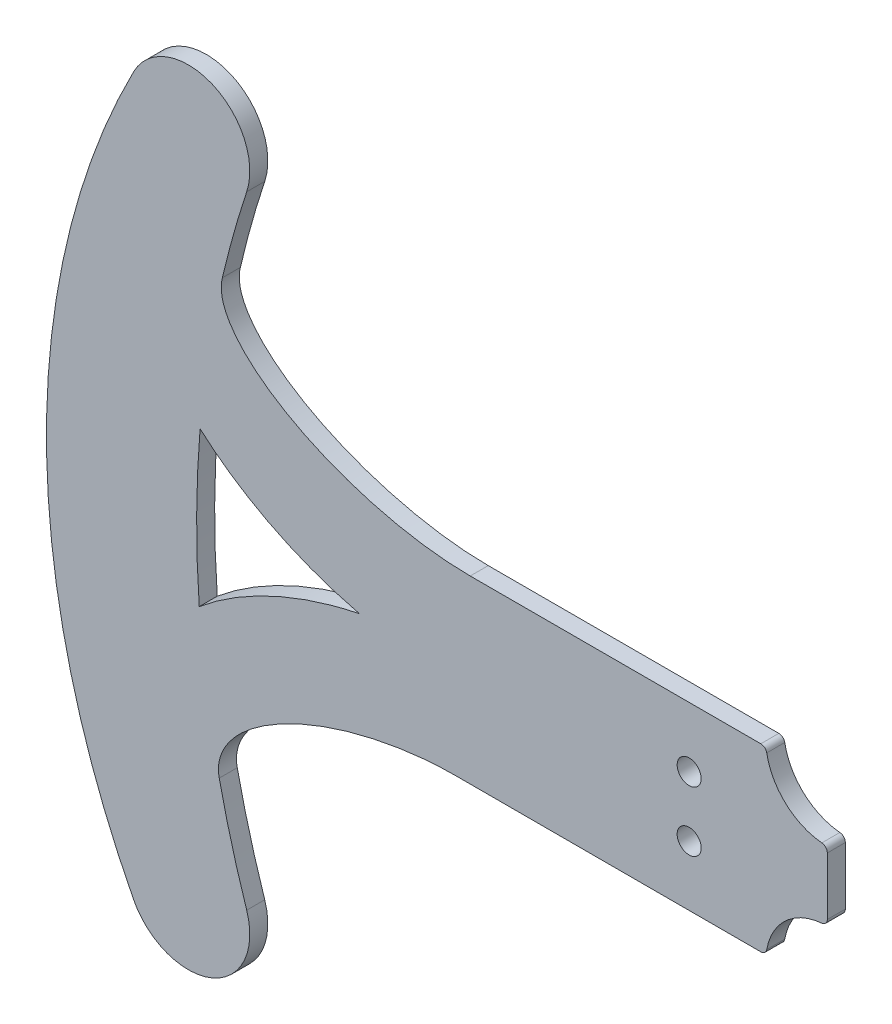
ISO-10303-21;
HEADER;
FILE_DESCRIPTION(('STEP AP214'),'2;1');
FILE_NAME('part.step','',(''),(''),'','','');
FILE_SCHEMA(('AUTOMOTIVE_DESIGN { 1 0 10303 214 1 1 1 1 }'));
ENDSEC;
DATA;
#1=APPLICATION_CONTEXT('core data for automotive mechanical design processes');
#2=APPLICATION_PROTOCOL_DEFINITION('international standard','automotive_design',2000,#1);
#3=PRODUCT_CONTEXT('',#1,'mechanical');
#4=PRODUCT('Part','Part','',(#3));
#5=PRODUCT_RELATED_PRODUCT_CATEGORY('part','',(#4));
#6=PRODUCT_DEFINITION_FORMATION('','',#4);
#7=PRODUCT_DEFINITION_CONTEXT('part definition',#1,'design');
#8=PRODUCT_DEFINITION('design','',#6,#7);
#9=PRODUCT_DEFINITION_SHAPE('','',#8);
#10=(LENGTH_UNIT() NAMED_UNIT(*) SI_UNIT(.MILLI.,.METRE.));
#11=(NAMED_UNIT(*) PLANE_ANGLE_UNIT() SI_UNIT($,.RADIAN.));
#12=(NAMED_UNIT(*) SI_UNIT($,.STERADIAN.) SOLID_ANGLE_UNIT());
#13=UNCERTAINTY_MEASURE_WITH_UNIT(LENGTH_MEASURE(1.E-05),#10,'distance_accuracy_value','');
#14=(GEOMETRIC_REPRESENTATION_CONTEXT(3) GLOBAL_UNCERTAINTY_ASSIGNED_CONTEXT((#13)) GLOBAL_UNIT_ASSIGNED_CONTEXT((#10,
#11,#12)) REPRESENTATION_CONTEXT('',''));
#15=CARTESIAN_POINT('',(0.,0.,0.));
#16=DIRECTION('',(0.,0.,1.));
#17=DIRECTION('',(1.,0.,0.));
#18=AXIS2_PLACEMENT_3D('',#15,#16,#17);
#19=CARTESIAN_POINT('',(-71.7050452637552,29.7169195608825,3.));
#20=DIRECTION('',(0.,0.,1.));
#21=DIRECTION('',(1.,0.,0.));
#22=AXIS2_PLACEMENT_3D('',#19,#20,#21);
#23=PLANE('',#22);
#24=CARTESIAN_POINT('',(-23.,5.,3.));
#25=DIRECTION('',(0.,0.,1.));
#26=DIRECTION('',(1.,0.,0.));
#27=AXIS2_PLACEMENT_3D('',#24,#25,#26);
#28=CIRCLE('',#27,2.);
#29=CARTESIAN_POINT('',(-21.,5.,3.));
#30=VERTEX_POINT('',#29);
#31=EDGE_CURVE('E179',#30,#30,#28,.T.);
#32=ORIENTED_EDGE('',*,*,#31,.F.);
#33=EDGE_LOOP('',(#32));
#34=FACE_BOUND('',#33,.T.);
#35=CARTESIAN_POINT('',(60.,0.,3.));
#36=DIRECTION('',(0.,0.,-1.));
#37=DIRECTION('',(1.,0.,0.));
#38=AXIS2_PLACEMENT_3D('',#35,#36,#37);
#39=CIRCLE('',#38,165.);
#40=CARTESIAN_POINT('',(-96.6626097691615,-51.7863563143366,3.));
#41=VERTEX_POINT('',#40);
#42=CARTESIAN_POINT('',(-101.237477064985,-35.0353534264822,3.));
#43=VERTEX_POINT('',#42);
#44=EDGE_CURVE('E325',#41,#43,#39,.T.);
#45=ORIENTED_EDGE('',*,*,#44,.T.);
#46=CARTESIAN_POINT('',(-71.8420437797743,-29.0459008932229,3.));
#47=DIRECTION('',(0.,0.,-1.));
#48=DIRECTION('',(-0.980460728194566,-0.196714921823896,0.));
#49=AXIS2_PLACEMENT_3D('',#46,#47,#48);
#50=ELLIPSE('',#49,30.,13.);
#51=CARTESIAN_POINT('',(-61.8043189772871,-15.,3.));
#52=VERTEX_POINT('',#51);
#53=EDGE_CURVE('E328',#43,#52,#50,.T.);
#54=ORIENTED_EDGE('',*,*,#53,.T.);
#55=DIRECTION('',(1.,0.,0.));
#56=VECTOR('',#55,1.);
#57=CARTESIAN_POINT('',(-11.0707949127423,-15.,3.));
#58=LINE('',#57,#56);
#59=CARTESIAN_POINT('',(-11.0707949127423,-15.,3.));
#60=VERTEX_POINT('',#59);
#61=EDGE_CURVE('E288',#52,#60,#58,.T.);
#62=ORIENTED_EDGE('',*,*,#61,.T.);
#63=CARTESIAN_POINT('',(-11.0707949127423,-14.,3.));
#64=DIRECTION('',(0.,0.,1.));
#65=DIRECTION('',(1.,0.,0.));
#66=AXIS2_PLACEMENT_3D('',#63,#64,#65);
#67=CIRCLE('',#66,0.999999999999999);
#68=CARTESIAN_POINT('',(-10.0867242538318,-14.1777777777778,3.));
#69=VERTEX_POINT('',#68);
#70=EDGE_CURVE('E397',#60,#69,#67,.T.);
#71=ORIENTED_EDGE('',*,*,#70,.T.);
#72=CARTESIAN_POINT('',(0.,-16.,3.));
#73=DIRECTION('',(0.,0.,-1.));
#74=DIRECTION('',(1.,0.,0.));
#75=AXIS2_PLACEMENT_3D('',#72,#73,#74);
#76=CIRCLE('',#75,10.25);
#77=CARTESIAN_POINT('',(-0.91111111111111,-5.79057413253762,3.));
#78=VERTEX_POINT('',#77);
#79=EDGE_CURVE('E396',#69,#78,#76,.T.);
#80=ORIENTED_EDGE('',*,*,#79,.T.);
#81=CARTESIAN_POINT('',(-0.999999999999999,-4.79453258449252,3.));
#82=DIRECTION('',(0.,0.,1.));
#83=DIRECTION('',(1.,0.,0.));
#84=AXIS2_PLACEMENT_3D('',#81,#82,#83);
#85=CIRCLE('',#84,1.);
#86=CARTESIAN_POINT('',(0.,-4.79453258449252,3.));
#87=VERTEX_POINT('',#86);
#88=EDGE_CURVE('E394',#78,#87,#85,.T.);
#89=ORIENTED_EDGE('',*,*,#88,.T.);
#90=DIRECTION('',(0.,1.,0.));
#91=VECTOR('',#90,1.);
#92=CARTESIAN_POINT('',(0.,4.79453258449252,3.));
#93=LINE('',#92,#91);
#94=CARTESIAN_POINT('',(0.,4.79453258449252,3.));
#95=VERTEX_POINT('',#94);
#96=EDGE_CURVE('E392',#87,#95,#93,.T.);
#97=ORIENTED_EDGE('',*,*,#96,.T.);
#98=CARTESIAN_POINT('',(-1.,4.79453258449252,3.));
#99=DIRECTION('',(0.,0.,1.));
#100=DIRECTION('',(1.,0.,0.));
#101=AXIS2_PLACEMENT_3D('',#98,#99,#100);
#102=CIRCLE('',#101,1.);
#103=CARTESIAN_POINT('',(-0.911111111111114,5.79057413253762,3.));
#104=VERTEX_POINT('',#103);
#105=EDGE_CURVE('E388',#95,#104,#102,.T.);
#106=ORIENTED_EDGE('',*,*,#105,.T.);
#107=CARTESIAN_POINT('',(0.,16.,3.));
#108=DIRECTION('',(0.,0.,-1.));
#109=DIRECTION('',(1.,0.,0.));
#110=AXIS2_PLACEMENT_3D('',#107,#108,#109);
#111=CIRCLE('',#110,10.25);
#112=CARTESIAN_POINT('',(-10.0867242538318,14.1777777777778,3.));
#113=VERTEX_POINT('',#112);
#114=EDGE_CURVE('E387',#104,#113,#111,.T.);
#115=ORIENTED_EDGE('',*,*,#114,.T.);
#116=CARTESIAN_POINT('',(-11.0707949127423,14.,3.));
#117=DIRECTION('',(0.,0.,1.));
#118=DIRECTION('',(1.,0.,0.));
#119=AXIS2_PLACEMENT_3D('',#116,#117,#118);
#120=CIRCLE('',#119,1.);
#121=CARTESIAN_POINT('',(-11.0707949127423,15.,3.));
#122=VERTEX_POINT('',#121);
#123=EDGE_CURVE('E386',#113,#122,#120,.T.);
#124=ORIENTED_EDGE('',*,*,#123,.T.);
#125=DIRECTION('',(-1.,0.,0.));
#126=VECTOR('',#125,1.);
#127=CARTESIAN_POINT('',(-59.4512131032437,15.,3.));
#128=LINE('',#127,#126);
#129=CARTESIAN_POINT('',(-59.4512131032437,15.,3.));
#130=VERTEX_POINT('',#129);
#131=EDGE_CURVE('E230',#122,#130,#128,.T.);
#132=ORIENTED_EDGE('',*,*,#131,.T.);
#133=CARTESIAN_POINT('',(-71.7050452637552,29.7169195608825,3.));
#134=DIRECTION('',(0.,0.,-1.));
#135=DIRECTION('',(-0.966902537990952,0.255146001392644,0.));
#136=AXIS2_PLACEMENT_3D('',#133,#134,#135);
#137=ELLIPSE('',#136,30.,13.);
#138=CARTESIAN_POINT('',(-100.712121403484,37.3712996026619,3.));
#139=VERTEX_POINT('',#138);
#140=EDGE_CURVE('E225',#130,#139,#137,.T.);
#141=ORIENTED_EDGE('',*,*,#140,.T.);
#142=CARTESIAN_POINT('',(60.,0.,3.));
#143=DIRECTION('',(0.,0.,-1.));
#144=DIRECTION('',(1.,0.,0.));
#145=AXIS2_PLACEMENT_3D('',#142,#143,#144);
#146=CIRCLE('',#145,165.);
#147=CARTESIAN_POINT('',(-96.6626097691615,51.7863563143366,3.));
#148=VERTEX_POINT('',#147);
#149=EDGE_CURVE('E229',#139,#148,#146,.T.);
#150=ORIENTED_EDGE('',*,*,#149,.T.);
#151=CARTESIAN_POINT('',(-106.384433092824,55.,3.));
#152=DIRECTION('',(0.,0.,1.));
#153=DIRECTION('',(1.,0.,0.));
#154=AXIS2_PLACEMENT_3D('',#151,#152,#153);
#155=CIRCLE('',#154,10.2392067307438);
#156=CARTESIAN_POINT('',(-115.479999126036,59.7023433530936,3.));
#157=VERTEX_POINT('',#156);
#158=EDGE_CURVE('E233',#148,#157,#155,.T.);
#159=ORIENTED_EDGE('',*,*,#158,.T.);
#160=CARTESIAN_POINT('',(0.,0.,3.));
#161=DIRECTION('',(0.,0.,1.));
#162=DIRECTION('',(1.,0.,0.));
#163=AXIS2_PLACEMENT_3D('',#160,#161,#162);
#164=CIRCLE('',#163,130.);
#165=CARTESIAN_POINT('',(-115.479999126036,-59.7023433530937,3.));
#166=VERTEX_POINT('',#165);
#167=EDGE_CURVE('E235',#157,#166,#164,.T.);
#168=ORIENTED_EDGE('',*,*,#167,.T.);
#169=CARTESIAN_POINT('',(-106.384433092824,-55.,3.));
#170=DIRECTION('',(0.,0.,1.));
#171=DIRECTION('',(1.,0.,0.));
#172=AXIS2_PLACEMENT_3D('',#169,#170,#171);
#173=CIRCLE('',#172,10.2392067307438);
#174=EDGE_CURVE('E237',#166,#41,#173,.T.);
#175=ORIENTED_EDGE('',*,*,#174,.T.);
#176=EDGE_LOOP('',(#45,#54,#62,#71,#80,#89,#97,#106,#115,#124,#132,#141,#150,#159,#168,#175));
#177=FACE_BOUND('',#176,.T.);
#178=CARTESIAN_POINT('',(-71.8420437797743,-29.0459008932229,3.));
#179=DIRECTION('',(0.,0.,-1.));
#180=DIRECTION('',(0.980460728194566,0.196714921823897,0.));
#181=AXIS2_PLACEMENT_3D('',#178,#179,#180);
#182=ELLIPSE('',#181,45.2509352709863,30.);
#183=CARTESIAN_POINT('',(-104.56533781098,-11.9686921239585,3.));
#184=VERTEX_POINT('',#183);
#185=CARTESIAN_POINT('',(-77.8874428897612,0.338878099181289,3.));
#186=VERTEX_POINT('',#185);
#187=EDGE_CURVE('E421',#184,#186,#182,.T.);
#188=ORIENTED_EDGE('',*,*,#187,.F.);
#189=CARTESIAN_POINT('',(60.,0.,3.));
#190=DIRECTION('',(0.,0.,1.));
#191=DIRECTION('',(1.,0.,0.));
#192=AXIS2_PLACEMENT_3D('',#189,#190,#191);
#193=CIRCLE('',#192,165.);
#194=CARTESIAN_POINT('',(-104.426529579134,13.7446851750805,3.));
#195=VERTEX_POINT('',#194);
#196=EDGE_CURVE('E189',#195,#184,#193,.T.);
#197=ORIENTED_EDGE('',*,*,#196,.F.);
#198=CARTESIAN_POINT('',(-71.7050452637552,29.7169195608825,3.));
#199=DIRECTION('',(0.,0.,-1.));
#200=DIRECTION('',(0.966902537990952,-0.255146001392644,0.));
#201=AXIS2_PLACEMENT_3D('',#198,#199,#200);
#202=ELLIPSE('',#201,45.2509352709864,30.);
#203=EDGE_CURVE('E174',#186,#195,#202,.T.);
#204=ORIENTED_EDGE('',*,*,#203,.F.);
#205=EDGE_LOOP('',(#188,#197,#204));
#206=FACE_BOUND('',#205,.T.);
#207=CARTESIAN_POINT('',(-23.,-5.,3.));
#208=DIRECTION('',(0.,0.,1.));
#209=DIRECTION('',(1.,0.,0.));
#210=AXIS2_PLACEMENT_3D('',#207,#208,#209);
#211=CIRCLE('',#210,2.);
#212=CARTESIAN_POINT('',(-21.,-5.,3.));
#213=VERTEX_POINT('',#212);
#214=EDGE_CURVE('E438',#213,#213,#211,.T.);
#215=ORIENTED_EDGE('',*,*,#214,.F.);
#216=EDGE_LOOP('',(#215));
#217=FACE_BOUND('',#216,.T.);
#218=ADVANCED_FACE('F31',(#34,#177,#206,#217),#23,.T.);
#219=CARTESIAN_POINT('',(-71.7050452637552,29.7169195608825,0.));
#220=DIRECTION('',(0.,0.,1.));
#221=DIRECTION('',(1.,0.,0.));
#222=AXIS2_PLACEMENT_3D('',#219,#220,#221);
#223=PLANE('',#222);
#224=CARTESIAN_POINT('',(-23.,5.,0.));
#225=DIRECTION('',(0.,0.,1.));
#226=DIRECTION('',(1.,0.,0.));
#227=AXIS2_PLACEMENT_3D('',#224,#225,#226);
#228=CIRCLE('',#227,2.);
#229=CARTESIAN_POINT('',(-21.,5.,0.));
#230=VERTEX_POINT('',#229);
#231=EDGE_CURVE('E182',#230,#230,#228,.T.);
#232=ORIENTED_EDGE('',*,*,#231,.T.);
#233=EDGE_LOOP('',(#232));
#234=FACE_BOUND('',#233,.T.);
#235=CARTESIAN_POINT('',(60.,0.,0.));
#236=DIRECTION('',(0.,0.,-1.));
#237=DIRECTION('',(1.,0.,0.));
#238=AXIS2_PLACEMENT_3D('',#235,#236,#237);
#239=CIRCLE('',#238,165.);
#240=CARTESIAN_POINT('',(-96.6626097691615,-51.7863563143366,0.));
#241=VERTEX_POINT('',#240);
#242=CARTESIAN_POINT('',(-101.237477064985,-35.0353534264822,0.));
#243=VERTEX_POINT('',#242);
#244=EDGE_CURVE('E175',#241,#243,#239,.T.);
#245=ORIENTED_EDGE('',*,*,#244,.F.);
#246=CARTESIAN_POINT('',(-106.384433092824,-55.,0.));
#247=DIRECTION('',(0.,0.,1.));
#248=DIRECTION('',(1.,0.,0.));
#249=AXIS2_PLACEMENT_3D('',#246,#247,#248);
#250=CIRCLE('',#249,10.2392067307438);
#251=CARTESIAN_POINT('',(-115.479999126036,-59.7023433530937,0.));
#252=VERTEX_POINT('',#251);
#253=EDGE_CURVE('E323',#252,#241,#250,.T.);
#254=ORIENTED_EDGE('',*,*,#253,.F.);
#255=CARTESIAN_POINT('',(0.,0.,0.));
#256=DIRECTION('',(0.,0.,1.));
#257=DIRECTION('',(1.,0.,0.));
#258=AXIS2_PLACEMENT_3D('',#255,#256,#257);
#259=CIRCLE('',#258,130.);
#260=CARTESIAN_POINT('',(-115.479999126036,59.7023433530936,0.));
#261=VERTEX_POINT('',#260);
#262=EDGE_CURVE('E321',#261,#252,#259,.T.);
#263=ORIENTED_EDGE('',*,*,#262,.F.);
#264=CARTESIAN_POINT('',(-106.384433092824,55.,0.));
#265=DIRECTION('',(0.,0.,1.));
#266=DIRECTION('',(1.,0.,0.));
#267=AXIS2_PLACEMENT_3D('',#264,#265,#266);
#268=CIRCLE('',#267,10.2392067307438);
#269=CARTESIAN_POINT('',(-96.6626097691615,51.7863563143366,0.));
#270=VERTEX_POINT('',#269);
#271=EDGE_CURVE('E319',#270,#261,#268,.T.);
#272=ORIENTED_EDGE('',*,*,#271,.F.);
#273=CARTESIAN_POINT('',(60.,0.,0.));
#274=DIRECTION('',(0.,0.,-1.));
#275=DIRECTION('',(1.,0.,0.));
#276=AXIS2_PLACEMENT_3D('',#273,#274,#275);
#277=CIRCLE('',#276,165.);
#278=CARTESIAN_POINT('',(-100.712121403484,37.3712996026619,0.));
#279=VERTEX_POINT('',#278);
#280=EDGE_CURVE('E317',#279,#270,#277,.T.);
#281=ORIENTED_EDGE('',*,*,#280,.F.);
#282=CARTESIAN_POINT('',(-71.7050452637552,29.7169195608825,0.));
#283=DIRECTION('',(0.,0.,-1.));
#284=DIRECTION('',(-0.966902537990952,0.255146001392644,0.));
#285=AXIS2_PLACEMENT_3D('',#282,#283,#284);
#286=ELLIPSE('',#285,30.,13.);
#287=CARTESIAN_POINT('',(-59.4512131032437,15.,0.));
#288=VERTEX_POINT('',#287);
#289=EDGE_CURVE('E315',#288,#279,#286,.T.);
#290=ORIENTED_EDGE('',*,*,#289,.F.);
#291=DIRECTION('',(-1.,0.,0.));
#292=VECTOR('',#291,1.);
#293=CARTESIAN_POINT('',(-59.4512131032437,15.,0.));
#294=LINE('',#293,#292);
#295=CARTESIAN_POINT('',(-11.0707949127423,15.,0.));
#296=VERTEX_POINT('',#295);
#297=EDGE_CURVE('E313',#296,#288,#294,.T.);
#298=ORIENTED_EDGE('',*,*,#297,.F.);
#299=CARTESIAN_POINT('',(-11.0707949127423,14.,0.));
#300=DIRECTION('',(0.,0.,1.));
#301=DIRECTION('',(1.,0.,0.));
#302=AXIS2_PLACEMENT_3D('',#299,#300,#301);
#303=CIRCLE('',#302,1.);
#304=CARTESIAN_POINT('',(-10.0867242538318,14.1777777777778,0.));
#305=VERTEX_POINT('',#304);
#306=EDGE_CURVE('E311',#305,#296,#303,.T.);
#307=ORIENTED_EDGE('',*,*,#306,.F.);
#308=CARTESIAN_POINT('',(0.,16.,0.));
#309=DIRECTION('',(0.,0.,-1.));
#310=DIRECTION('',(1.,0.,0.));
#311=AXIS2_PLACEMENT_3D('',#308,#309,#310);
#312=CIRCLE('',#311,10.25);
#313=CARTESIAN_POINT('',(-0.911111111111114,5.79057413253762,0.));
#314=VERTEX_POINT('',#313);
#315=EDGE_CURVE('E309',#314,#305,#312,.T.);
#316=ORIENTED_EDGE('',*,*,#315,.F.);
#317=CARTESIAN_POINT('',(-1.,4.79453258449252,0.));
#318=DIRECTION('',(0.,0.,1.));
#319=DIRECTION('',(1.,0.,0.));
#320=AXIS2_PLACEMENT_3D('',#317,#318,#319);
#321=CIRCLE('',#320,1.);
#322=CARTESIAN_POINT('',(0.,4.79453258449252,0.));
#323=VERTEX_POINT('',#322);
#324=EDGE_CURVE('E307',#323,#314,#321,.T.);
#325=ORIENTED_EDGE('',*,*,#324,.F.);
#326=DIRECTION('',(0.,1.,0.));
#327=VECTOR('',#326,1.);
#328=CARTESIAN_POINT('',(0.,4.79453258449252,0.));
#329=LINE('',#328,#327);
#330=CARTESIAN_POINT('',(0.,-4.79453258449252,0.));
#331=VERTEX_POINT('',#330);
#332=EDGE_CURVE('E305',#331,#323,#329,.T.);
#333=ORIENTED_EDGE('',*,*,#332,.F.);
#334=CARTESIAN_POINT('',(-0.999999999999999,-4.79453258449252,0.));
#335=DIRECTION('',(0.,0.,1.));
#336=DIRECTION('',(1.,0.,0.));
#337=AXIS2_PLACEMENT_3D('',#334,#335,#336);
#338=CIRCLE('',#337,1.);
#339=CARTESIAN_POINT('',(-0.91111111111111,-5.79057413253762,0.));
#340=VERTEX_POINT('',#339);
#341=EDGE_CURVE('E303',#340,#331,#338,.T.);
#342=ORIENTED_EDGE('',*,*,#341,.F.);
#343=CARTESIAN_POINT('',(0.,-16.,0.));
#344=DIRECTION('',(0.,0.,-1.));
#345=DIRECTION('',(1.,0.,0.));
#346=AXIS2_PLACEMENT_3D('',#343,#344,#345);
#347=CIRCLE('',#346,10.25);
#348=CARTESIAN_POINT('',(-10.0867242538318,-14.1777777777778,0.));
#349=VERTEX_POINT('',#348);
#350=EDGE_CURVE('E297',#349,#340,#347,.T.);
#351=ORIENTED_EDGE('',*,*,#350,.F.);
#352=CARTESIAN_POINT('',(-11.0707949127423,-14.,0.));
#353=DIRECTION('',(0.,0.,1.));
#354=DIRECTION('',(1.,0.,0.));
#355=AXIS2_PLACEMENT_3D('',#352,#353,#354);
#356=CIRCLE('',#355,0.999999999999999);
#357=CARTESIAN_POINT('',(-11.0707949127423,-15.,0.));
#358=VERTEX_POINT('',#357);
#359=EDGE_CURVE('E295',#358,#349,#356,.T.);
#360=ORIENTED_EDGE('',*,*,#359,.F.);
#361=DIRECTION('',(1.,0.,0.));
#362=VECTOR('',#361,1.);
#363=CARTESIAN_POINT('',(-11.0707949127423,-15.,0.));
#364=LINE('',#363,#362);
#365=CARTESIAN_POINT('',(-61.8043189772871,-15.,0.));
#366=VERTEX_POINT('',#365);
#367=EDGE_CURVE('E287',#366,#358,#364,.T.);
#368=ORIENTED_EDGE('',*,*,#367,.F.);
#369=CARTESIAN_POINT('',(-71.8420437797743,-29.0459008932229,0.));
#370=DIRECTION('',(0.,0.,-1.));
#371=DIRECTION('',(-0.980460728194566,-0.196714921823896,0.));
#372=AXIS2_PLACEMENT_3D('',#369,#370,#371);
#373=ELLIPSE('',#372,30.,13.);
#374=EDGE_CURVE('E293',#243,#366,#373,.T.);
#375=ORIENTED_EDGE('',*,*,#374,.F.);
#376=EDGE_LOOP('',(#245,#254,#263,#272,#281,#290,#298,#307,#316,#325,#333,#342,#351,#360,#368,#375));
#377=FACE_BOUND('',#376,.T.);
#378=CARTESIAN_POINT('',(-71.7050452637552,29.7169195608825,0.));
#379=DIRECTION('',(0.,0.,-1.));
#380=DIRECTION('',(0.966902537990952,-0.255146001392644,0.));
#381=AXIS2_PLACEMENT_3D('',#378,#379,#380);
#382=ELLIPSE('',#381,45.2509352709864,30.);
#383=CARTESIAN_POINT('',(-77.8874428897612,0.338878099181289,0.));
#384=VERTEX_POINT('',#383);
#385=CARTESIAN_POINT('',(-104.426529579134,13.7446851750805,0.));
#386=VERTEX_POINT('',#385);
#387=EDGE_CURVE('E167',#384,#386,#382,.T.);
#388=ORIENTED_EDGE('',*,*,#387,.T.);
#389=CARTESIAN_POINT('',(60.,0.,0.));
#390=DIRECTION('',(0.,0.,1.));
#391=DIRECTION('',(1.,0.,0.));
#392=AXIS2_PLACEMENT_3D('',#389,#390,#391);
#393=CIRCLE('',#392,165.);
#394=CARTESIAN_POINT('',(-104.56533781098,-11.9686921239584,0.));
#395=VERTEX_POINT('',#394);
#396=EDGE_CURVE('E160',#386,#395,#393,.T.);
#397=ORIENTED_EDGE('',*,*,#396,.T.);
#398=CARTESIAN_POINT('',(-71.8420437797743,-29.0459008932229,0.));
#399=DIRECTION('',(0.,0.,-1.));
#400=DIRECTION('',(0.980460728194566,0.196714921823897,0.));
#401=AXIS2_PLACEMENT_3D('',#398,#399,#400);
#402=ELLIPSE('',#401,45.2509352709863,30.);
#403=EDGE_CURVE('E51',#395,#384,#402,.T.);
#404=ORIENTED_EDGE('',*,*,#403,.T.);
#405=EDGE_LOOP('',(#388,#397,#404));
#406=FACE_BOUND('',#405,.T.);
#407=CARTESIAN_POINT('',(-23.,-5.,0.));
#408=DIRECTION('',(0.,0.,1.));
#409=DIRECTION('',(1.,0.,0.));
#410=AXIS2_PLACEMENT_3D('',#407,#408,#409);
#411=CIRCLE('',#410,2.);
#412=CARTESIAN_POINT('',(-21.,-5.,0.));
#413=VERTEX_POINT('',#412);
#414=EDGE_CURVE('E441',#413,#413,#411,.T.);
#415=ORIENTED_EDGE('',*,*,#414,.T.);
#416=EDGE_LOOP('',(#415));
#417=FACE_BOUND('',#416,.T.);
#418=ADVANCED_FACE('F177',(#234,#377,#406,#417),#223,.F.);
#419=CARTESIAN_POINT('',(60.,0.,3.));
#420=DIRECTION('',(0.,0.,-1.));
#421=DIRECTION('',(-1.,0.,0.));
#422=AXIS2_PLACEMENT_3D('',#419,#420,#421);
#423=CYLINDRICAL_SURFACE('',#422,165.);
#424=ORIENTED_EDGE('',*,*,#244,.T.);
#425=DIRECTION('',(0.,0.,-1.));
#426=VECTOR('',#425,1.);
#427=CARTESIAN_POINT('',(-101.237477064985,-35.0353534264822,3.));
#428=LINE('',#427,#426);
#429=EDGE_CURVE('E11',#43,#243,#428,.T.);
#430=ORIENTED_EDGE('',*,*,#429,.F.);
#431=ORIENTED_EDGE('',*,*,#44,.F.);
#432=DIRECTION('',(0.,0.,-1.));
#433=VECTOR('',#432,1.);
#434=CARTESIAN_POINT('',(-96.6626097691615,-51.7863563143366,3.));
#435=LINE('',#434,#433);
#436=EDGE_CURVE('E239',#41,#241,#435,.T.);
#437=ORIENTED_EDGE('',*,*,#436,.T.);
#438=EDGE_LOOP('',(#424,#430,#431,#437));
#439=FACE_BOUND('',#438,.T.);
#440=ADVANCED_FACE('F33',(#439),#423,.F.);
#441=DIRECTION('',(0.,0.,-1.));
#442=VECTOR('',#441,1.);
#443=SURFACE_OF_LINEAR_EXTRUSION('',#50,#442);
#444=ORIENTED_EDGE('',*,*,#374,.T.);
#445=DIRECTION('',(0.,0.,-1.));
#446=VECTOR('',#445,1.);
#447=CARTESIAN_POINT('',(-61.8043189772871,-15.,3.));
#448=LINE('',#447,#446);
#449=EDGE_CURVE('E39',#52,#366,#448,.T.);
#450=ORIENTED_EDGE('',*,*,#449,.F.);
#451=ORIENTED_EDGE('',*,*,#53,.F.);
#452=ORIENTED_EDGE('',*,*,#429,.T.);
#453=EDGE_LOOP('',(#444,#450,#451,#452));
#454=FACE_BOUND('',#453,.T.);
#455=ADVANCED_FACE('F332',(#454),#443,.F.);
#456=CARTESIAN_POINT('',(-11.0707949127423,-15.,3.));
#457=DIRECTION('',(0.,1.,0.));
#458=DIRECTION('',(-1.,0.,0.));
#459=AXIS2_PLACEMENT_3D('',#456,#457,#458);
#460=PLANE('',#459);
#461=ORIENTED_EDGE('',*,*,#367,.T.);
#462=DIRECTION('',(0.,0.,-1.));
#463=VECTOR('',#462,1.);
#464=CARTESIAN_POINT('',(-11.0707949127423,-15.,3.));
#465=LINE('',#464,#463);
#466=EDGE_CURVE('E278',#60,#358,#465,.T.);
#467=ORIENTED_EDGE('',*,*,#466,.F.);
#468=ORIENTED_EDGE('',*,*,#61,.F.);
#469=ORIENTED_EDGE('',*,*,#449,.T.);
#470=EDGE_LOOP('',(#461,#467,#468,#469));
#471=FACE_BOUND('',#470,.T.);
#472=ADVANCED_FACE('F285',(#471),#460,.F.);
#473=CARTESIAN_POINT('',(-11.0707949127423,-14.,3.));
#474=DIRECTION('',(0.,0.,-1.));
#475=DIRECTION('',(-1.,0.,0.));
#476=AXIS2_PLACEMENT_3D('',#473,#474,#475);
#477=CYLINDRICAL_SURFACE('',#476,0.999999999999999);
#478=ORIENTED_EDGE('',*,*,#359,.T.);
#479=DIRECTION('',(0.,0.,-1.));
#480=VECTOR('',#479,1.);
#481=CARTESIAN_POINT('',(-10.0867242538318,-14.1777777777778,3.));
#482=LINE('',#481,#480);
#483=EDGE_CURVE('E275',#69,#349,#482,.T.);
#484=ORIENTED_EDGE('',*,*,#483,.F.);
#485=ORIENTED_EDGE('',*,*,#70,.F.);
#486=ORIENTED_EDGE('',*,*,#466,.T.);
#487=EDGE_LOOP('',(#478,#484,#485,#486));
#488=FACE_BOUND('',#487,.T.);
#489=ADVANCED_FACE('F337',(#488),#477,.T.);
#490=CARTESIAN_POINT('',(0.,-16.,3.));
#491=DIRECTION('',(0.,0.,-1.));
#492=DIRECTION('',(-1.,0.,0.));
#493=AXIS2_PLACEMENT_3D('',#490,#491,#492);
#494=CYLINDRICAL_SURFACE('',#493,10.25);
#495=ORIENTED_EDGE('',*,*,#350,.T.);
#496=DIRECTION('',(0.,0.,-1.));
#497=VECTOR('',#496,1.);
#498=CARTESIAN_POINT('',(-0.91111111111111,-5.79057413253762,3.));
#499=LINE('',#498,#497);
#500=EDGE_CURVE('E272',#78,#340,#499,.T.);
#501=ORIENTED_EDGE('',*,*,#500,.F.);
#502=ORIENTED_EDGE('',*,*,#79,.F.);
#503=ORIENTED_EDGE('',*,*,#483,.T.);
#504=EDGE_LOOP('',(#495,#501,#502,#503));
#505=FACE_BOUND('',#504,.T.);
#506=ADVANCED_FACE('F340',(#505),#494,.F.);
#507=CARTESIAN_POINT('',(-0.999999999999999,-4.79453258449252,3.));
#508=DIRECTION('',(0.,0.,-1.));
#509=DIRECTION('',(-1.,0.,0.));
#510=AXIS2_PLACEMENT_3D('',#507,#508,#509);
#511=CYLINDRICAL_SURFACE('',#510,1.);
#512=ORIENTED_EDGE('',*,*,#341,.T.);
#513=DIRECTION('',(0.,0.,-1.));
#514=VECTOR('',#513,1.);
#515=CARTESIAN_POINT('',(0.,-4.79453258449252,3.));
#516=LINE('',#515,#514);
#517=EDGE_CURVE('E269',#87,#331,#516,.T.);
#518=ORIENTED_EDGE('',*,*,#517,.F.);
#519=ORIENTED_EDGE('',*,*,#88,.F.);
#520=ORIENTED_EDGE('',*,*,#500,.T.);
#521=EDGE_LOOP('',(#512,#518,#519,#520));
#522=FACE_BOUND('',#521,.T.);
#523=ADVANCED_FACE('F344',(#522),#511,.T.);
#524=CARTESIAN_POINT('',(0.,4.79453258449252,3.));
#525=DIRECTION('',(-1.,0.,0.));
#526=DIRECTION('',(0.,-1.,0.));
#527=AXIS2_PLACEMENT_3D('',#524,#525,#526);
#528=PLANE('',#527);
#529=ORIENTED_EDGE('',*,*,#332,.T.);
#530=DIRECTION('',(0.,0.,-1.));
#531=VECTOR('',#530,1.);
#532=CARTESIAN_POINT('',(0.,4.79453258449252,3.));
#533=LINE('',#532,#531);
#534=EDGE_CURVE('E266',#95,#323,#533,.T.);
#535=ORIENTED_EDGE('',*,*,#534,.F.);
#536=ORIENTED_EDGE('',*,*,#96,.F.);
#537=ORIENTED_EDGE('',*,*,#517,.T.);
#538=EDGE_LOOP('',(#529,#535,#536,#537));
#539=FACE_BOUND('',#538,.T.);
#540=ADVANCED_FACE('F348',(#539),#528,.F.);
#541=CARTESIAN_POINT('',(-1.,4.79453258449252,3.));
#542=DIRECTION('',(0.,0.,-1.));
#543=DIRECTION('',(-1.,0.,0.));
#544=AXIS2_PLACEMENT_3D('',#541,#542,#543);
#545=CYLINDRICAL_SURFACE('',#544,1.);
#546=ORIENTED_EDGE('',*,*,#324,.T.);
#547=DIRECTION('',(0.,0.,-1.));
#548=VECTOR('',#547,1.);
#549=CARTESIAN_POINT('',(-0.911111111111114,5.79057413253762,3.));
#550=LINE('',#549,#548);
#551=EDGE_CURVE('E263',#104,#314,#550,.T.);
#552=ORIENTED_EDGE('',*,*,#551,.F.);
#553=ORIENTED_EDGE('',*,*,#105,.F.);
#554=ORIENTED_EDGE('',*,*,#534,.T.);
#555=EDGE_LOOP('',(#546,#552,#553,#554));
#556=FACE_BOUND('',#555,.T.);
#557=ADVANCED_FACE('F352',(#556),#545,.T.);
#558=CARTESIAN_POINT('',(0.,16.,3.));
#559=DIRECTION('',(0.,0.,-1.));
#560=DIRECTION('',(-1.,0.,0.));
#561=AXIS2_PLACEMENT_3D('',#558,#559,#560);
#562=CYLINDRICAL_SURFACE('',#561,10.25);
#563=ORIENTED_EDGE('',*,*,#315,.T.);
#564=DIRECTION('',(0.,0.,-1.));
#565=VECTOR('',#564,1.);
#566=CARTESIAN_POINT('',(-10.0867242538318,14.1777777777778,3.));
#567=LINE('',#566,#565);
#568=EDGE_CURVE('E260',#113,#305,#567,.T.);
#569=ORIENTED_EDGE('',*,*,#568,.F.);
#570=ORIENTED_EDGE('',*,*,#114,.F.);
#571=ORIENTED_EDGE('',*,*,#551,.T.);
#572=EDGE_LOOP('',(#563,#569,#570,#571));
#573=FACE_BOUND('',#572,.T.);
#574=ADVANCED_FACE('F356',(#573),#562,.F.);
#575=CARTESIAN_POINT('',(-11.0707949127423,14.,3.));
#576=DIRECTION('',(0.,0.,-1.));
#577=DIRECTION('',(-1.,0.,0.));
#578=AXIS2_PLACEMENT_3D('',#575,#576,#577);
#579=CYLINDRICAL_SURFACE('',#578,1.);
#580=ORIENTED_EDGE('',*,*,#306,.T.);
#581=DIRECTION('',(0.,0.,-1.));
#582=VECTOR('',#581,1.);
#583=CARTESIAN_POINT('',(-11.0707949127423,15.,3.));
#584=LINE('',#583,#582);
#585=EDGE_CURVE('E257',#122,#296,#584,.T.);
#586=ORIENTED_EDGE('',*,*,#585,.F.);
#587=ORIENTED_EDGE('',*,*,#123,.F.);
#588=ORIENTED_EDGE('',*,*,#568,.T.);
#589=EDGE_LOOP('',(#580,#586,#587,#588));
#590=FACE_BOUND('',#589,.T.);
#591=ADVANCED_FACE('F359',(#590),#579,.T.);
#592=CARTESIAN_POINT('',(-59.4512131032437,15.,3.));
#593=DIRECTION('',(0.,-1.,0.));
#594=DIRECTION('',(1.,0.,0.));
#595=AXIS2_PLACEMENT_3D('',#592,#593,#594);
#596=PLANE('',#595);
#597=ORIENTED_EDGE('',*,*,#297,.T.);
#598=DIRECTION('',(0.,0.,-1.));
#599=VECTOR('',#598,1.);
#600=CARTESIAN_POINT('',(-59.4512131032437,15.,3.));
#601=LINE('',#600,#599);
#602=EDGE_CURVE('E254',#130,#288,#601,.T.);
#603=ORIENTED_EDGE('',*,*,#602,.F.);
#604=ORIENTED_EDGE('',*,*,#131,.F.);
#605=ORIENTED_EDGE('',*,*,#585,.T.);
#606=EDGE_LOOP('',(#597,#603,#604,#605));
#607=FACE_BOUND('',#606,.T.);
#608=ADVANCED_FACE('F222',(#607),#596,.F.);
#609=DIRECTION('',(0.,0.,-1.));
#610=VECTOR('',#609,1.);
#611=SURFACE_OF_LINEAR_EXTRUSION('',#137,#610);
#612=ORIENTED_EDGE('',*,*,#289,.T.);
#613=DIRECTION('',(0.,0.,-1.));
#614=VECTOR('',#613,1.);
#615=CARTESIAN_POINT('',(-100.712121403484,37.3712996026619,3.));
#616=LINE('',#615,#614);
#617=EDGE_CURVE('E251',#139,#279,#616,.T.);
#618=ORIENTED_EDGE('',*,*,#617,.F.);
#619=ORIENTED_EDGE('',*,*,#140,.F.);
#620=ORIENTED_EDGE('',*,*,#602,.T.);
#621=EDGE_LOOP('',(#612,#618,#619,#620));
#622=FACE_BOUND('',#621,.T.);
#623=ADVANCED_FACE('F217',(#622),#611,.F.);
#624=CARTESIAN_POINT('',(60.,0.,3.));
#625=DIRECTION('',(0.,0.,-1.));
#626=DIRECTION('',(-1.,0.,0.));
#627=AXIS2_PLACEMENT_3D('',#624,#625,#626);
#628=CYLINDRICAL_SURFACE('',#627,165.);
#629=ORIENTED_EDGE('',*,*,#280,.T.);
#630=DIRECTION('',(0.,0.,-1.));
#631=VECTOR('',#630,1.);
#632=CARTESIAN_POINT('',(-96.6626097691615,51.7863563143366,3.));
#633=LINE('',#632,#631);
#634=EDGE_CURVE('E248',#148,#270,#633,.T.);
#635=ORIENTED_EDGE('',*,*,#634,.F.);
#636=ORIENTED_EDGE('',*,*,#149,.F.);
#637=ORIENTED_EDGE('',*,*,#617,.T.);
#638=EDGE_LOOP('',(#629,#635,#636,#637));
#639=FACE_BOUND('',#638,.T.);
#640=ADVANCED_FACE('F213',(#639),#628,.F.);
#641=CARTESIAN_POINT('',(-106.384433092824,55.,3.));
#642=DIRECTION('',(0.,0.,-1.));
#643=DIRECTION('',(-1.,0.,0.));
#644=AXIS2_PLACEMENT_3D('',#641,#642,#643);
#645=CYLINDRICAL_SURFACE('',#644,10.2392067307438);
#646=ORIENTED_EDGE('',*,*,#271,.T.);
#647=DIRECTION('',(0.,0.,-1.));
#648=VECTOR('',#647,1.);
#649=CARTESIAN_POINT('',(-115.479999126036,59.7023433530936,3.));
#650=LINE('',#649,#648);
#651=EDGE_CURVE('E245',#157,#261,#650,.T.);
#652=ORIENTED_EDGE('',*,*,#651,.F.);
#653=ORIENTED_EDGE('',*,*,#158,.F.);
#654=ORIENTED_EDGE('',*,*,#634,.T.);
#655=EDGE_LOOP('',(#646,#652,#653,#654));
#656=FACE_BOUND('',#655,.T.);
#657=ADVANCED_FACE('F209',(#656),#645,.T.);
#658=CARTESIAN_POINT('',(0.,0.,3.));
#659=DIRECTION('',(0.,0.,-1.));
#660=DIRECTION('',(-1.,0.,0.));
#661=AXIS2_PLACEMENT_3D('',#658,#659,#660);
#662=CYLINDRICAL_SURFACE('',#661,130.);
#663=ORIENTED_EDGE('',*,*,#262,.T.);
#664=DIRECTION('',(0.,0.,-1.));
#665=VECTOR('',#664,1.);
#666=CARTESIAN_POINT('',(-115.479999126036,-59.7023433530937,3.));
#667=LINE('',#666,#665);
#668=EDGE_CURVE('E242',#166,#252,#667,.T.);
#669=ORIENTED_EDGE('',*,*,#668,.F.);
#670=ORIENTED_EDGE('',*,*,#167,.F.);
#671=ORIENTED_EDGE('',*,*,#651,.T.);
#672=EDGE_LOOP('',(#663,#669,#670,#671));
#673=FACE_BOUND('',#672,.T.);
#674=ADVANCED_FACE('F205',(#673),#662,.T.);
#675=CARTESIAN_POINT('',(-106.384433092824,-55.,3.));
#676=DIRECTION('',(0.,0.,-1.));
#677=DIRECTION('',(-1.,0.,0.));
#678=AXIS2_PLACEMENT_3D('',#675,#676,#677);
#679=CYLINDRICAL_SURFACE('',#678,10.2392067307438);
#680=ORIENTED_EDGE('',*,*,#253,.T.);
#681=ORIENTED_EDGE('',*,*,#436,.F.);
#682=ORIENTED_EDGE('',*,*,#174,.F.);
#683=ORIENTED_EDGE('',*,*,#668,.T.);
#684=EDGE_LOOP('',(#680,#681,#682,#683));
#685=FACE_BOUND('',#684,.T.);
#686=ADVANCED_FACE('F195',(#685),#679,.T.);
#687=DIRECTION('',(0.,0.,-1.));
#688=VECTOR('',#687,1.);
#689=SURFACE_OF_LINEAR_EXTRUSION('',#202,#688);
#690=ORIENTED_EDGE('',*,*,#387,.F.);
#691=DIRECTION('',(0.,0.,-1.));
#692=VECTOR('',#691,1.);
#693=CARTESIAN_POINT('',(-77.8874428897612,0.338878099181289,3.));
#694=LINE('',#693,#692);
#695=EDGE_CURVE('E420',#186,#384,#694,.T.);
#696=ORIENTED_EDGE('',*,*,#695,.F.);
#697=ORIENTED_EDGE('',*,*,#203,.T.);
#698=DIRECTION('',(0.,0.,-1.));
#699=VECTOR('',#698,1.);
#700=CARTESIAN_POINT('',(-104.426529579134,13.7446851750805,3.));
#701=LINE('',#700,#699);
#702=EDGE_CURVE('E163',#195,#386,#701,.T.);
#703=ORIENTED_EDGE('',*,*,#702,.T.);
#704=EDGE_LOOP('',(#690,#696,#697,#703));
#705=FACE_BOUND('',#704,.T.);
#706=ADVANCED_FACE('F171',(#705),#689,.T.);
#707=CARTESIAN_POINT('',(60.,0.,3.));
#708=DIRECTION('',(0.,0.,-1.));
#709=DIRECTION('',(-1.,0.,0.));
#710=AXIS2_PLACEMENT_3D('',#707,#708,#709);
#711=CYLINDRICAL_SURFACE('',#710,165.);
#712=ORIENTED_EDGE('',*,*,#396,.F.);
#713=ORIENTED_EDGE('',*,*,#702,.F.);
#714=ORIENTED_EDGE('',*,*,#196,.T.);
#715=DIRECTION('',(0.,0.,-1.));
#716=VECTOR('',#715,1.);
#717=CARTESIAN_POINT('',(-104.56533781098,-11.9686921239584,3.));
#718=LINE('',#717,#716);
#719=EDGE_CURVE('E46',#184,#395,#718,.T.);
#720=ORIENTED_EDGE('',*,*,#719,.T.);
#721=EDGE_LOOP('',(#712,#713,#714,#720));
#722=FACE_BOUND('',#721,.T.);
#723=ADVANCED_FACE('F162',(#722),#711,.F.);
#724=DIRECTION('',(0.,0.,-1.));
#725=VECTOR('',#724,1.);
#726=SURFACE_OF_LINEAR_EXTRUSION('',#182,#725);
#727=ORIENTED_EDGE('',*,*,#403,.F.);
#728=ORIENTED_EDGE('',*,*,#719,.F.);
#729=ORIENTED_EDGE('',*,*,#187,.T.);
#730=ORIENTED_EDGE('',*,*,#695,.T.);
#731=EDGE_LOOP('',(#727,#728,#729,#730));
#732=FACE_BOUND('',#731,.T.);
#733=ADVANCED_FACE('F423',(#732),#726,.T.);
#734=CARTESIAN_POINT('',(-23.,5.,3.));
#735=DIRECTION('',(0.,0.,-1.));
#736=DIRECTION('',(-1.,0.,0.));
#737=AXIS2_PLACEMENT_3D('',#734,#735,#736);
#738=CYLINDRICAL_SURFACE('',#737,2.);
#739=ORIENTED_EDGE('',*,*,#31,.T.);
#740=EDGE_LOOP('',(#739));
#741=FACE_BOUND('',#740,.T.);
#742=ORIENTED_EDGE('',*,*,#231,.F.);
#743=EDGE_LOOP('',(#742));
#744=FACE_BOUND('',#743,.T.);
#745=ADVANCED_FACE('F426',(#741,#744),#738,.F.);
#746=CARTESIAN_POINT('',(-23.,-5.,3.));
#747=DIRECTION('',(0.,0.,-1.));
#748=DIRECTION('',(-1.,0.,0.));
#749=AXIS2_PLACEMENT_3D('',#746,#747,#748);
#750=CYLINDRICAL_SURFACE('',#749,2.);
#751=ORIENTED_EDGE('',*,*,#214,.T.);
#752=EDGE_LOOP('',(#751));
#753=FACE_BOUND('',#752,.T.);
#754=ORIENTED_EDGE('',*,*,#414,.F.);
#755=EDGE_LOOP('',(#754));
#756=FACE_BOUND('',#755,.T.);
#757=ADVANCED_FACE('F429',(#753,#756),#750,.F.);
#758=CLOSED_SHELL('',(#218,#418,#440,#455,#472,#489,#506,#523,#540,#557,#574,#591,#608,#623,
#640,#657,#674,#686,#706,#723,#733,#745,#757));
#759=MANIFOLD_SOLID_BREP('B2',#758);
#760=ADVANCED_BREP_SHAPE_REPRESENTATION('',(#18,#759),#14);
#761=SHAPE_DEFINITION_REPRESENTATION(#9,#760);
ENDSEC;
END-ISO-10303-21;
